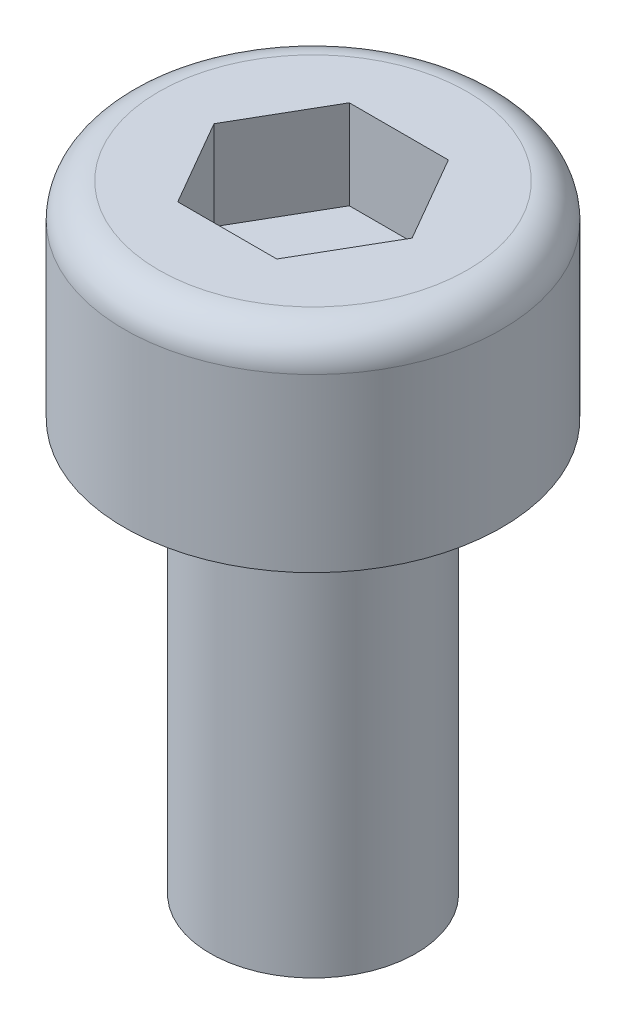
from build123d import *

# Parameters (mm, degrees)
SCHNITT_LINEAR_AUSTRAGEN1_DEPTH = 1.3


with BuildPart() as part:
    # Skizze1 → Rotation1 (revolve)
    with BuildSketch(Plane.XY, mode=Mode.PRIVATE) as rotation1_sk:
        with BuildLine():
            Line((0, 0), (-1.5, 0))
            Line((-1.5, 0), (-1.5, 6))
            Line((-1.5, 6), (-2.75, 6))
            Line((-2.75, 6), (-2.75, 8.5))
            ThreePointArc((-2.75, 8.5), (-2.603553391, 8.853553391), (-2.25, 9))
            Line((-2.25, 9), (0, 9))
            Line((0, 9), (0, 0))
        make_face()
    revolve(rotation1_sk.sketch.rotate(Axis((0, 0, 0), (0, 1, 0)), 270), axis=Axis((0, 0, 0), (0, 1, 0)))

    # Skizze2 → Schnitt-Linear austragen1 (cut)
    with BuildSketch(Plane(origin=(0, 9, 0), x_dir=(1, 0, 0), z_dir=(0, 1, 0))):
        Polygon((0.721687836, 1.25), (-0.721687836, 1.25), (-1.443375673, 0), (-0.721687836, -1.25), (0.721687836, -1.25), (1.443375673, 0), align=None)
    extrude(amount=-SCHNITT_LINEAR_AUSTRAGEN1_DEPTH, mode=Mode.SUBTRACT)


solid = part.part
